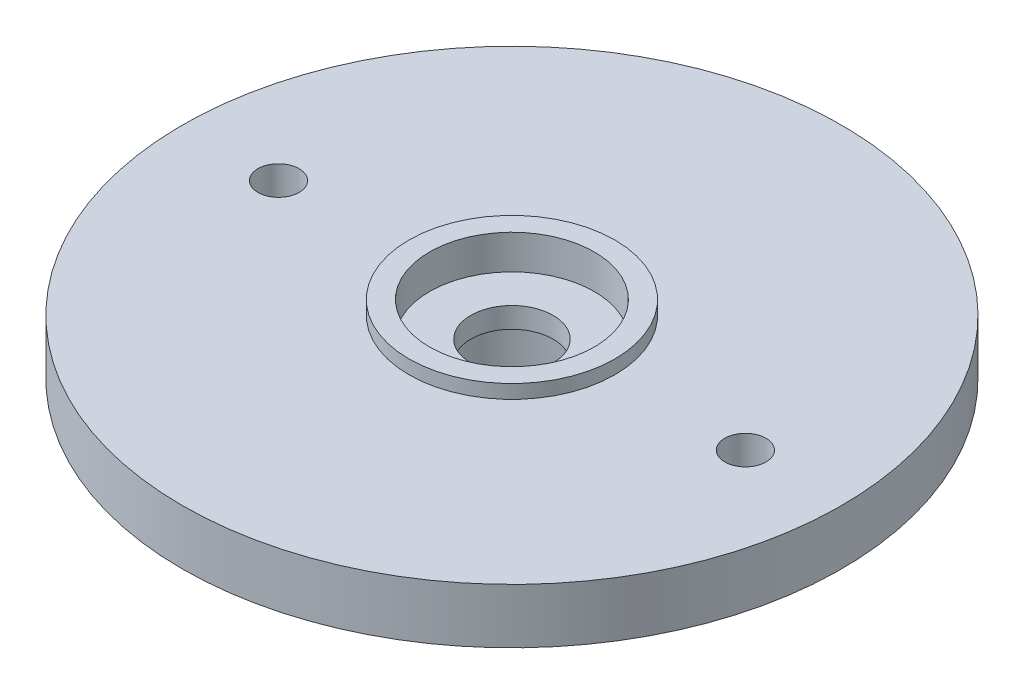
ISO-10303-21;
HEADER;
FILE_DESCRIPTION(('STEP AP214'),'2;1');
FILE_NAME('part.step','',(''),(''),'','','');
FILE_SCHEMA(('AUTOMOTIVE_DESIGN { 1 0 10303 214 1 1 1 1 }'));
ENDSEC;
DATA;
#1=APPLICATION_CONTEXT('core data for automotive mechanical design processes');
#2=APPLICATION_PROTOCOL_DEFINITION('international standard','automotive_design',2000,#1);
#3=PRODUCT_CONTEXT('',#1,'mechanical');
#4=PRODUCT('Part','Part','',(#3));
#5=PRODUCT_RELATED_PRODUCT_CATEGORY('part','',(#4));
#6=PRODUCT_DEFINITION_FORMATION('','',#4);
#7=PRODUCT_DEFINITION_CONTEXT('part definition',#1,'design');
#8=PRODUCT_DEFINITION('design','',#6,#7);
#9=PRODUCT_DEFINITION_SHAPE('','',#8);
#10=(LENGTH_UNIT() NAMED_UNIT(*) SI_UNIT(.MILLI.,.METRE.));
#11=(NAMED_UNIT(*) PLANE_ANGLE_UNIT() SI_UNIT($,.RADIAN.));
#12=(NAMED_UNIT(*) SI_UNIT($,.STERADIAN.) SOLID_ANGLE_UNIT());
#13=UNCERTAINTY_MEASURE_WITH_UNIT(LENGTH_MEASURE(1.E-05),#10,'distance_accuracy_value','');
#14=(GEOMETRIC_REPRESENTATION_CONTEXT(3) GLOBAL_UNCERTAINTY_ASSIGNED_CONTEXT((#13)) GLOBAL_UNIT_ASSIGNED_CONTEXT((#10,
#11,#12)) REPRESENTATION_CONTEXT('',''));
#15=CARTESIAN_POINT('',(0.,0.,0.));
#16=DIRECTION('',(0.,0.,1.));
#17=DIRECTION('',(1.,0.,0.));
#18=AXIS2_PLACEMENT_3D('',#15,#16,#17);
#19=CARTESIAN_POINT('',(12.,4.5,0.));
#20=DIRECTION('',(0.,-1.,0.));
#21=DIRECTION('',(0.,0.,-1.));
#22=AXIS2_PLACEMENT_3D('',#19,#20,#21);
#23=PLANE('',#22);
#24=CARTESIAN_POINT('',(-8.5,4.5,0.));
#25=DIRECTION('',(0.,1.,0.));
#26=DIRECTION('',(0.,0.,-1.));
#27=AXIS2_PLACEMENT_3D('',#24,#25,#26);
#28=CIRCLE('',#27,0.75);
#29=CARTESIAN_POINT('',(-8.5,4.5,-0.75));
#30=VERTEX_POINT('',#29);
#31=EDGE_CURVE('E59',#30,#30,#28,.T.);
#32=ORIENTED_EDGE('',*,*,#31,.F.);
#33=EDGE_LOOP('',(#32));
#34=FACE_BOUND('',#33,.T.);
#35=CARTESIAN_POINT('',(8.5,4.5,0.));
#36=DIRECTION('',(0.,1.,0.));
#37=DIRECTION('',(0.,0.,1.));
#38=AXIS2_PLACEMENT_3D('',#35,#36,#37);
#39=CIRCLE('',#38,0.75);
#40=CARTESIAN_POINT('',(8.5,4.5,0.75));
#41=VERTEX_POINT('',#40);
#42=EDGE_CURVE('E48',#41,#41,#39,.T.);
#43=ORIENTED_EDGE('',*,*,#42,.F.);
#44=EDGE_LOOP('',(#43));
#45=FACE_BOUND('',#44,.T.);
#46=CARTESIAN_POINT('',(0.,4.5,0.));
#47=DIRECTION('',(0.,1.,0.));
#48=DIRECTION('',(0.,0.,1.));
#49=AXIS2_PLACEMENT_3D('',#46,#47,#48);
#50=CIRCLE('',#49,3.75);
#51=CARTESIAN_POINT('',(0.,4.5,3.75));
#52=VERTEX_POINT('',#51);
#53=EDGE_CURVE('E47',#52,#52,#50,.T.);
#54=ORIENTED_EDGE('',*,*,#53,.F.);
#55=EDGE_LOOP('',(#54));
#56=FACE_BOUND('',#55,.T.);
#57=CARTESIAN_POINT('',(0.,4.5,0.));
#58=DIRECTION('',(0.,1.,0.));
#59=DIRECTION('',(0.,0.,1.));
#60=AXIS2_PLACEMENT_3D('',#57,#58,#59);
#61=CIRCLE('',#60,12.);
#62=CARTESIAN_POINT('',(0.,4.5,12.));
#63=VERTEX_POINT('',#62);
#64=EDGE_CURVE('E10',#63,#63,#61,.T.);
#65=ORIENTED_EDGE('',*,*,#64,.T.);
#66=EDGE_LOOP('',(#65));
#67=FACE_BOUND('',#66,.T.);
#68=ADVANCED_FACE('F30',(#34,#45,#56,#67),#23,.F.);
#69=CARTESIAN_POINT('',(0.,9.56085964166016,0.));
#70=DIRECTION('',(0.,1.,0.));
#71=DIRECTION('',(0.,0.,1.));
#72=AXIS2_PLACEMENT_3D('',#69,#70,#71);
#73=CYLINDRICAL_SURFACE('',#72,12.);
#74=ORIENTED_EDGE('',*,*,#64,.F.);
#75=EDGE_LOOP('',(#74));
#76=FACE_BOUND('',#75,.T.);
#77=CARTESIAN_POINT('',(0.,2.5,0.));
#78=DIRECTION('',(0.,1.,0.));
#79=DIRECTION('',(0.,0.,1.));
#80=AXIS2_PLACEMENT_3D('',#77,#78,#79);
#81=CIRCLE('',#80,12.);
#82=CARTESIAN_POINT('',(0.,2.5,12.));
#83=VERTEX_POINT('',#82);
#84=EDGE_CURVE('E37',#83,#83,#81,.T.);
#85=ORIENTED_EDGE('',*,*,#84,.T.);
#86=EDGE_LOOP('',(#85));
#87=FACE_BOUND('',#86,.T.);
#88=ADVANCED_FACE('F145',(#76,#87),#73,.T.);
#89=CARTESIAN_POINT('',(4.5,2.5,0.));
#90=DIRECTION('',(0.,1.,0.));
#91=DIRECTION('',(0.,0.,1.));
#92=AXIS2_PLACEMENT_3D('',#89,#90,#91);
#93=PLANE('',#92);
#94=CARTESIAN_POINT('',(-8.5,2.5,0.));
#95=DIRECTION('',(0.,1.,0.));
#96=DIRECTION('',(0.,0.,1.));
#97=AXIS2_PLACEMENT_3D('',#94,#95,#96);
#98=CIRCLE('',#97,0.75);
#99=CARTESIAN_POINT('',(-8.5,2.5,0.75));
#100=VERTEX_POINT('',#99);
#101=EDGE_CURVE('E33',#100,#100,#98,.T.);
#102=ORIENTED_EDGE('',*,*,#101,.T.);
#103=EDGE_LOOP('',(#102));
#104=FACE_BOUND('',#103,.T.);
#105=CARTESIAN_POINT('',(8.5,2.5,0.));
#106=DIRECTION('',(0.,1.,0.));
#107=DIRECTION('',(0.,0.,1.));
#108=AXIS2_PLACEMENT_3D('',#105,#106,#107);
#109=CIRCLE('',#108,0.75);
#110=CARTESIAN_POINT('',(8.5,2.5,0.75));
#111=VERTEX_POINT('',#110);
#112=EDGE_CURVE('E45',#111,#111,#109,.T.);
#113=ORIENTED_EDGE('',*,*,#112,.T.);
#114=EDGE_LOOP('',(#113));
#115=FACE_BOUND('',#114,.T.);
#116=ORIENTED_EDGE('',*,*,#84,.F.);
#117=EDGE_LOOP('',(#116));
#118=FACE_BOUND('',#117,.T.);
#119=CARTESIAN_POINT('',(0.,2.5,0.));
#120=DIRECTION('',(0.,1.,0.));
#121=DIRECTION('',(0.,0.,1.));
#122=AXIS2_PLACEMENT_3D('',#119,#120,#121);
#123=CIRCLE('',#122,4.5);
#124=CARTESIAN_POINT('',(0.,2.5,4.5));
#125=VERTEX_POINT('',#124);
#126=EDGE_CURVE('E42',#125,#125,#123,.T.);
#127=ORIENTED_EDGE('',*,*,#126,.T.);
#128=EDGE_LOOP('',(#127));
#129=FACE_BOUND('',#128,.T.);
#130=ADVANCED_FACE('F87',(#104,#115,#118,#129),#93,.F.);
#131=CARTESIAN_POINT('',(0.,9.56085964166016,0.));
#132=DIRECTION('',(0.,1.,0.));
#133=DIRECTION('',(0.,0.,1.));
#134=AXIS2_PLACEMENT_3D('',#131,#132,#133);
#135=CYLINDRICAL_SURFACE('',#134,4.5);
#136=ORIENTED_EDGE('',*,*,#126,.F.);
#137=EDGE_LOOP('',(#136));
#138=FACE_BOUND('',#137,.T.);
#139=CARTESIAN_POINT('',(0.,0.,0.));
#140=DIRECTION('',(0.,1.,0.));
#141=DIRECTION('',(0.,0.,1.));
#142=AXIS2_PLACEMENT_3D('',#139,#140,#141);
#143=CIRCLE('',#142,4.5);
#144=CARTESIAN_POINT('',(0.,0.,4.5));
#145=VERTEX_POINT('',#144);
#146=EDGE_CURVE('E82',#145,#145,#143,.T.);
#147=ORIENTED_EDGE('',*,*,#146,.T.);
#148=EDGE_LOOP('',(#147));
#149=FACE_BOUND('',#148,.T.);
#150=ADVANCED_FACE('F89',(#138,#149),#135,.T.);
#151=CARTESIAN_POINT('',(3.00000000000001,0.,0.));
#152=DIRECTION('',(0.,1.,0.));
#153=DIRECTION('',(0.,0.,1.));
#154=AXIS2_PLACEMENT_3D('',#151,#152,#153);
#155=PLANE('',#154);
#156=ORIENTED_EDGE('',*,*,#146,.F.);
#157=EDGE_LOOP('',(#156));
#158=FACE_BOUND('',#157,.T.);
#159=CARTESIAN_POINT('',(0.,0.,0.));
#160=DIRECTION('',(0.,1.,0.));
#161=DIRECTION('',(0.,0.,1.));
#162=AXIS2_PLACEMENT_3D('',#159,#160,#161);
#163=CIRCLE('',#162,3.00000000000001);
#164=CARTESIAN_POINT('',(0.,0.,3.00000000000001));
#165=VERTEX_POINT('',#164);
#166=EDGE_CURVE('E79',#165,#165,#163,.T.);
#167=ORIENTED_EDGE('',*,*,#166,.T.);
#168=EDGE_LOOP('',(#167));
#169=FACE_BOUND('',#168,.T.);
#170=ADVANCED_FACE('F92',(#158,#169),#155,.F.);
#171=CARTESIAN_POINT('',(0.,9.56085964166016,0.));
#172=DIRECTION('',(0.,1.,0.));
#173=DIRECTION('',(0.,0.,1.));
#174=AXIS2_PLACEMENT_3D('',#171,#172,#173);
#175=CYLINDRICAL_SURFACE('',#174,3.00000000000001);
#176=ORIENTED_EDGE('',*,*,#166,.F.);
#177=EDGE_LOOP('',(#176));
#178=FACE_BOUND('',#177,.T.);
#179=CARTESIAN_POINT('',(0.,3.,0.));
#180=DIRECTION('',(0.,1.,0.));
#181=DIRECTION('',(0.,0.,1.));
#182=AXIS2_PLACEMENT_3D('',#179,#180,#181);
#183=CIRCLE('',#182,3.00000000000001);
#184=CARTESIAN_POINT('',(0.,3.,3.00000000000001));
#185=VERTEX_POINT('',#184);
#186=EDGE_CURVE('E76',#185,#185,#183,.T.);
#187=ORIENTED_EDGE('',*,*,#186,.T.);
#188=EDGE_LOOP('',(#187));
#189=FACE_BOUND('',#188,.T.);
#190=ADVANCED_FACE('F98',(#178,#189),#175,.F.);
#191=CARTESIAN_POINT('',(1.50000000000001,3.,0.));
#192=DIRECTION('',(0.,1.,0.));
#193=DIRECTION('',(0.,0.,1.));
#194=AXIS2_PLACEMENT_3D('',#191,#192,#193);
#195=PLANE('',#194);
#196=ORIENTED_EDGE('',*,*,#186,.F.);
#197=EDGE_LOOP('',(#196));
#198=FACE_BOUND('',#197,.T.);
#199=CARTESIAN_POINT('',(0.,3.,0.));
#200=DIRECTION('',(0.,1.,0.));
#201=DIRECTION('',(0.,0.,1.));
#202=AXIS2_PLACEMENT_3D('',#199,#200,#201);
#203=CIRCLE('',#202,1.50000000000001);
#204=CARTESIAN_POINT('',(0.,3.,1.50000000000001));
#205=VERTEX_POINT('',#204);
#206=EDGE_CURVE('E73',#205,#205,#203,.T.);
#207=ORIENTED_EDGE('',*,*,#206,.T.);
#208=EDGE_LOOP('',(#207));
#209=FACE_BOUND('',#208,.T.);
#210=ADVANCED_FACE('F104',(#198,#209),#195,.F.);
#211=CARTESIAN_POINT('',(0.,9.56085964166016,0.));
#212=DIRECTION('',(0.,1.,0.));
#213=DIRECTION('',(0.,0.,1.));
#214=AXIS2_PLACEMENT_3D('',#211,#212,#213);
#215=CYLINDRICAL_SURFACE('',#214,1.50000000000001);
#216=ORIENTED_EDGE('',*,*,#206,.F.);
#217=EDGE_LOOP('',(#216));
#218=FACE_BOUND('',#217,.T.);
#219=CARTESIAN_POINT('',(0.,3.75,0.));
#220=DIRECTION('',(0.,1.,0.));
#221=DIRECTION('',(0.,0.,1.));
#222=AXIS2_PLACEMENT_3D('',#219,#220,#221);
#223=CIRCLE('',#222,1.50000000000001);
#224=CARTESIAN_POINT('',(0.,3.75,1.50000000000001));
#225=VERTEX_POINT('',#224);
#226=EDGE_CURVE('E70',#225,#225,#223,.T.);
#227=ORIENTED_EDGE('',*,*,#226,.T.);
#228=EDGE_LOOP('',(#227));
#229=FACE_BOUND('',#228,.T.);
#230=ADVANCED_FACE('F110',(#218,#229),#215,.F.);
#231=CARTESIAN_POINT('',(3.00000000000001,3.75,0.));
#232=DIRECTION('',(0.,-1.,0.));
#233=DIRECTION('',(0.,0.,-1.));
#234=AXIS2_PLACEMENT_3D('',#231,#232,#233);
#235=PLANE('',#234);
#236=ORIENTED_EDGE('',*,*,#226,.F.);
#237=EDGE_LOOP('',(#236));
#238=FACE_BOUND('',#237,.T.);
#239=CARTESIAN_POINT('',(0.,3.75,0.));
#240=DIRECTION('',(0.,1.,0.));
#241=DIRECTION('',(0.,0.,1.));
#242=AXIS2_PLACEMENT_3D('',#239,#240,#241);
#243=CIRCLE('',#242,3.00000000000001);
#244=CARTESIAN_POINT('',(0.,3.75,3.00000000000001));
#245=VERTEX_POINT('',#244);
#246=EDGE_CURVE('E67',#245,#245,#243,.T.);
#247=ORIENTED_EDGE('',*,*,#246,.T.);
#248=EDGE_LOOP('',(#247));
#249=FACE_BOUND('',#248,.T.);
#250=ADVANCED_FACE('F116',(#238,#249),#235,.F.);
#251=CARTESIAN_POINT('',(0.,9.56085964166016,0.));
#252=DIRECTION('',(0.,1.,0.));
#253=DIRECTION('',(0.,0.,1.));
#254=AXIS2_PLACEMENT_3D('',#251,#252,#253);
#255=CYLINDRICAL_SURFACE('',#254,3.00000000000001);
#256=ORIENTED_EDGE('',*,*,#246,.F.);
#257=EDGE_LOOP('',(#256));
#258=FACE_BOUND('',#257,.T.);
#259=CARTESIAN_POINT('',(0.,5.,0.));
#260=DIRECTION('',(0.,1.,0.));
#261=DIRECTION('',(0.,0.,1.));
#262=AXIS2_PLACEMENT_3D('',#259,#260,#261);
#263=CIRCLE('',#262,3.00000000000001);
#264=CARTESIAN_POINT('',(0.,5.,3.00000000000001));
#265=VERTEX_POINT('',#264);
#266=EDGE_CURVE('E64',#265,#265,#263,.T.);
#267=ORIENTED_EDGE('',*,*,#266,.T.);
#268=EDGE_LOOP('',(#267));
#269=FACE_BOUND('',#268,.T.);
#270=ADVANCED_FACE('F122',(#258,#269),#255,.F.);
#271=CARTESIAN_POINT('',(3.75,5.,0.));
#272=DIRECTION('',(0.,-1.,0.));
#273=DIRECTION('',(0.,0.,-1.));
#274=AXIS2_PLACEMENT_3D('',#271,#272,#273);
#275=PLANE('',#274);
#276=ORIENTED_EDGE('',*,*,#266,.F.);
#277=EDGE_LOOP('',(#276));
#278=FACE_BOUND('',#277,.T.);
#279=CARTESIAN_POINT('',(0.,5.,0.));
#280=DIRECTION('',(0.,1.,0.));
#281=DIRECTION('',(0.,0.,1.));
#282=AXIS2_PLACEMENT_3D('',#279,#280,#281);
#283=CIRCLE('',#282,3.75);
#284=CARTESIAN_POINT('',(0.,5.,3.75));
#285=VERTEX_POINT('',#284);
#286=EDGE_CURVE('E52',#285,#285,#283,.T.);
#287=ORIENTED_EDGE('',*,*,#286,.T.);
#288=EDGE_LOOP('',(#287));
#289=FACE_BOUND('',#288,.T.);
#290=ADVANCED_FACE('F128',(#278,#289),#275,.F.);
#291=CARTESIAN_POINT('',(0.,9.56085964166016,0.));
#292=DIRECTION('',(0.,1.,0.));
#293=DIRECTION('',(0.,0.,1.));
#294=AXIS2_PLACEMENT_3D('',#291,#292,#293);
#295=CYLINDRICAL_SURFACE('',#294,3.75);
#296=ORIENTED_EDGE('',*,*,#286,.F.);
#297=EDGE_LOOP('',(#296));
#298=FACE_BOUND('',#297,.T.);
#299=ORIENTED_EDGE('',*,*,#53,.T.);
#300=EDGE_LOOP('',(#299));
#301=FACE_BOUND('',#300,.T.);
#302=ADVANCED_FACE('F134',(#298,#301),#295,.T.);
#303=CARTESIAN_POINT('',(8.5,0.,0.));
#304=DIRECTION('',(0.,1.,0.));
#305=DIRECTION('',(0.,0.,1.));
#306=AXIS2_PLACEMENT_3D('',#303,#304,#305);
#307=CYLINDRICAL_SURFACE('',#306,0.75);
#308=ORIENTED_EDGE('',*,*,#42,.T.);
#309=EDGE_LOOP('',(#308));
#310=FACE_BOUND('',#309,.T.);
#311=ORIENTED_EDGE('',*,*,#112,.F.);
#312=EDGE_LOOP('',(#311));
#313=FACE_BOUND('',#312,.T.);
#314=ADVANCED_FACE('F140',(#310,#313),#307,.F.);
#315=CARTESIAN_POINT('',(-8.5,0.,0.));
#316=DIRECTION('',(0.,1.,0.));
#317=DIRECTION('',(0.,0.,1.));
#318=AXIS2_PLACEMENT_3D('',#315,#316,#317);
#319=CYLINDRICAL_SURFACE('',#318,0.75);
#320=ORIENTED_EDGE('',*,*,#31,.T.);
#321=EDGE_LOOP('',(#320));
#322=FACE_BOUND('',#321,.T.);
#323=ORIENTED_EDGE('',*,*,#101,.F.);
#324=EDGE_LOOP('',(#323));
#325=FACE_BOUND('',#324,.T.);
#326=ADVANCED_FACE('F155',(#322,#325),#319,.F.);
#327=CLOSED_SHELL('',(#68,#88,#130,#150,#170,#190,#210,#230,#250,#270,#290,#302,#314,#326));
#328=MANIFOLD_SOLID_BREP('B2',#327);
#329=ADVANCED_BREP_SHAPE_REPRESENTATION('',(#18,#328),#14);
#330=SHAPE_DEFINITION_REPRESENTATION(#9,#329);
ENDSEC;
END-ISO-10303-21;
